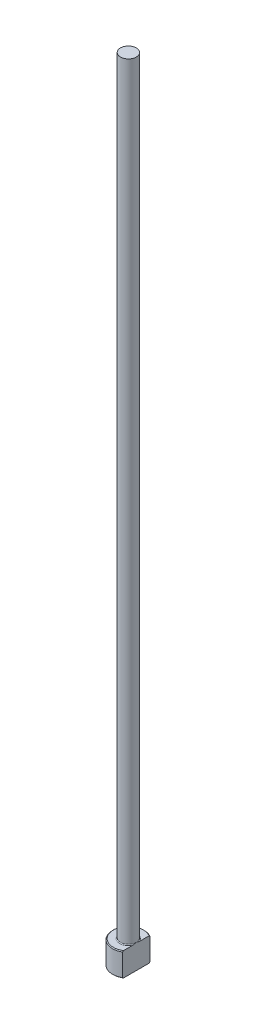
from build123d import *
from build123d.topology import SkipClean

# Parameters (mm, degrees)
CHAMFER1_SIZE    = 0.2
FILLET1_R        = 0.2
KEYED_HEAD_DEPTH = 201.079984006


with BuildPart() as part:
    # Sketch1 → Revolve1 (revolve)
    with BuildSketch(Plane.XY, mode=Mode.PRIVATE) as revolve1_sk:
        Polygon((0, 0), (-4, 0), (-4, 6), (-2, 6), (-2, 200), (0, 200), align=None)
    revolve(revolve1_sk.sketch.rotate(Axis((0, 259.958771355, 0), (0, -1, 0)), 270), axis=Axis((0, 259.958771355, 0), (0, -1, 0)))

    # Chamfer1
    chamfer1_edges = [part.edges().sort_by_distance(p)[0] for p in [
        (0, 6, -4),
        (0, 0, -4),
    ]]
    chamfer(chamfer1_edges, length=CHAMFER1_SIZE)

    # Fillet1
    fillet1_edges = [part.edges().sort_by_distance(p)[0] for p in [
        (0, 6, -2),
    ]]
    fillet(fillet1_edges, radius=FILLET1_R)

    # Sketch2 → KEYED HEAD (cut, through all)
    with SkipClean():  # the faces are left unmerged after this step: merging them gives an invalid solid
        with BuildSketch(Plane(origin=(0, 0, 0), x_dir=(1, 0, 0), z_dir=(0, 1, 0))):
            with BuildLine():
                Line((2, -3.464101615), (2, 3.464101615))
                ThreePointArc((2, 3.464101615), (4, 0), (2, -3.464101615))
            make_face()
        extrude(amount=KEYED_HEAD_DEPTH, mode=Mode.SUBTRACT)


solid = part.part
